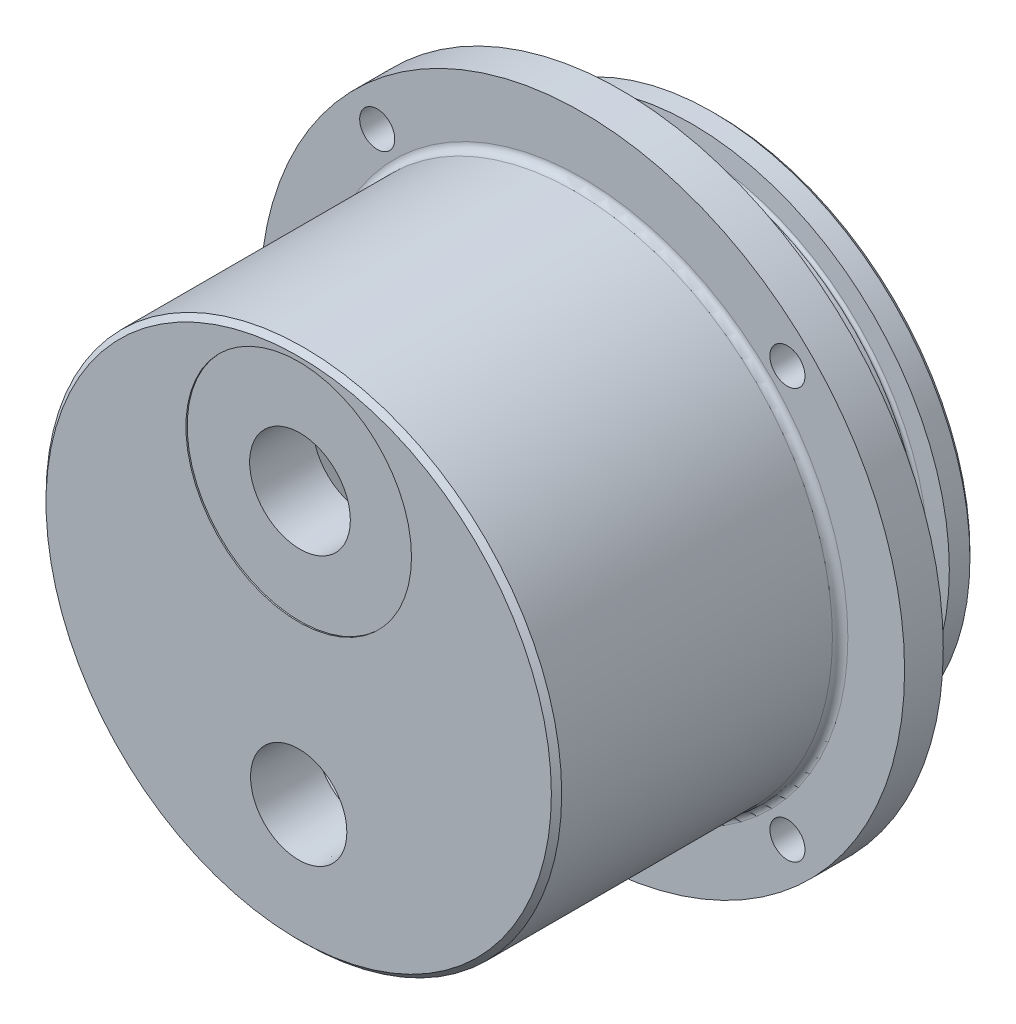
from build123d import *

# Parameters (mm, degrees)
SKETCH1_R                    = 25.3619
SKETCH1_R_2                  = 19.05
EXTRUDE1_DEPTH               = 9.525
EXTRUDE3_START               = 25.4
SKETCH2_R                    = 31.75
SKETCH2_R_2                  = 19.05
EXTRUDE3_DEPTH               = 25.4
EXTRUDE4_START               = 6.35
SKETCH3_R                    = 31.75
EXTRUDE4_DEPTH               = 6.35
CHAMFER1_SIZE                = 0.508
SKETCH4_R                    = 1.7272
CUT_EXTRUDE1_DEPTH           = 61.989758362
SKETCH11_R                   = 40.626139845
SKETCH11_R_2                 = 25.4
CUT_EXTRUDE3_DEPTH           = 27.94
FILLET1_R                    = 0.762
CHAMFER2_SIZE                = 0.508
F_7_16_20_TAPPED_HOLE1_D     = 9.92124
F_7_16_20_TAPPED_HOLE1_DEPTH = 28.575
F_7_16_20_TAPPED_HOLE1_TIP   = 2.980641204
SKETCH16_R                   = 11.1125
CUT_EXTRUDE4_DEPTH           = 0.127
FILLET2_R                    = 0.762


with BuildPart() as part:
    # Sketch1 → Extrude1 (new body)
    with BuildSketch(Plane.XY):
        Circle(SKETCH1_R)
        Circle(SKETCH1_R_2, mode=Mode.SUBTRACT)
    extrude(amount=-EXTRUDE1_DEPTH)

    # Sketch2 → Extrude3 (add)
    with BuildSketch(Plane.XY.offset(EXTRUDE3_START)):
        Circle(SKETCH2_R)
        Circle(SKETCH2_R_2, mode=Mode.SUBTRACT)
    extrude(amount=-EXTRUDE3_DEPTH)

    # Sketch3 → Extrude4 (add)
    with BuildSketch(Plane.XY.offset(25.4).offset(EXTRUDE4_START)):
        Circle(SKETCH3_R)
    extrude(amount=-EXTRUDE4_DEPTH)

    # Chamfer1
    chamfer1_edges = [part.edges().sort_by_distance(p)[0] for p in [
        (-25.3619, 0, -9.525),
        (-19.05, 0, -9.525),
    ]]
    chamfer(chamfer1_edges, length=CHAMFER1_SIZE)

    # Sketch4 → Cut-Extrude1 (cut, through all)
    with BuildSketch(Plane.XY.offset(31.75)):
        with Locations((-20.205576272, 20.205576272)):
            Circle(SKETCH4_R)
        with Locations((20.205576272, 20.205576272)):
            Circle(SKETCH4_R)
        with Locations((-20.205576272, -20.205576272)):
            Circle(SKETCH4_R)
        with Locations((20.205576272, -20.205576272)):
            Circle(SKETCH4_R)
    extrude(amount=-CUT_EXTRUDE1_DEPTH, mode=Mode.SUBTRACT)

    # Sketch9 → Groove for AS 568-133_ O-Ring1 (revolve, cut)
    with BuildSketch(Plane(origin=(0, 0, -9.525), x_dir=(0, -1, 0), z_dir=(-1, 0, 0)), mode=Mode.PRIVATE) as groove_for_as_568_133_o_ring1_sk:
        with BuildLine():
            Line((23.388920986, 6.25836987), (25.3619, 6.430983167))
            Line((25.3619, 6.430983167), (25.3619, 2.54))
            Line((25.3619, 2.54), (23.455589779, 2.706780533))
            ThreePointArc((23.455589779, 2.706780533), (23.232061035, 2.820835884), (23.2156, 3.07124107))
            Line((23.2156, 3.07124107), (23.2156, 6.121174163))
            ThreePointArc((23.2156, 6.121174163), (23.286553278, 6.209615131), (23.388920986, 6.25836987))
        make_face()
    revolve(groove_for_as_568_133_o_ring1_sk.sketch.rotate(Axis((0, 0, 40.475), (0, 0, -1)), 90), axis=Axis((0, 0, 40.475), (0, 0, -1)), mode=Mode.SUBTRACT)

    # Sketch11 → Cut-Extrude3 (cut)
    with BuildSketch(Plane.XY.offset(31.75)):
        Circle(SKETCH11_R)
        Circle(SKETCH11_R_2, mode=Mode.SUBTRACT)
    extrude(amount=-CUT_EXTRUDE3_DEPTH, mode=Mode.SUBTRACT)

    # Fillet1
    fillet1_edges = [part.edges().sort_by_distance(p)[0] for p in [
        (-25.4, 0, 3.81),
    ]]
    fillet(fillet1_edges, radius=FILLET1_R)

    # Chamfer2
    chamfer2_edges = [part.edges().sort_by_distance(p)[0] for p in [
        (-25.4, 0, 31.75),
    ]]
    chamfer(chamfer2_edges, length=CHAMFER2_SIZE)

    # 7_16-20 Tapped Hole1
    with Locations(Plane(origin=(0, 13.335, 31.75), x_dir=(1, 0, 0), z_dir=(0, 0, 1))):
        with Locations((0, 0)):
            Hole(F_7_16_20_TAPPED_HOLE1_D / 2, depth=F_7_16_20_TAPPED_HOLE1_DEPTH)
            with Locations((0, 0, -(F_7_16_20_TAPPED_HOLE1_DEPTH + F_7_16_20_TAPPED_HOLE1_TIP / 2))):  # 118° drill point
                Cone(0, F_7_16_20_TAPPED_HOLE1_D / 2, F_7_16_20_TAPPED_HOLE1_TIP, mode=Mode.SUBTRACT)

    # Sketch15 → 1_8 NPT Tapped Hole1 (revolve, cut)
    with BuildSketch(Plane(origin=(0, -13.335, 31.75), x_dir=(0, -1, 0), z_dir=(1, 0, 0))):
        Polygon((0, 0), (0, 14.217468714), (4.2164, 11.684), (4.2164, 6.858), (4.537401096, 6.858), (4.7427388, 0), align=None)
    revolve(axis=Axis((0, -13.335, 38.1), (0, 0, -1)), mode=Mode.SUBTRACT)

    # Sketch16 → Cut-Extrude4 (cut)
    with BuildSketch(Plane.XY.offset(31.75)):
        with Locations((0, 13.335)):
            Circle(SKETCH16_R)
    extrude(amount=-CUT_EXTRUDE4_DEPTH, mode=Mode.SUBTRACT)

    # Fillet2
    fillet2_edges = [part.edges().sort_by_distance(p)[0] for p in [
        (-19.05, 0, 25.4),
    ]]
    fillet(fillet2_edges, radius=FILLET2_R)


solid = part.part
